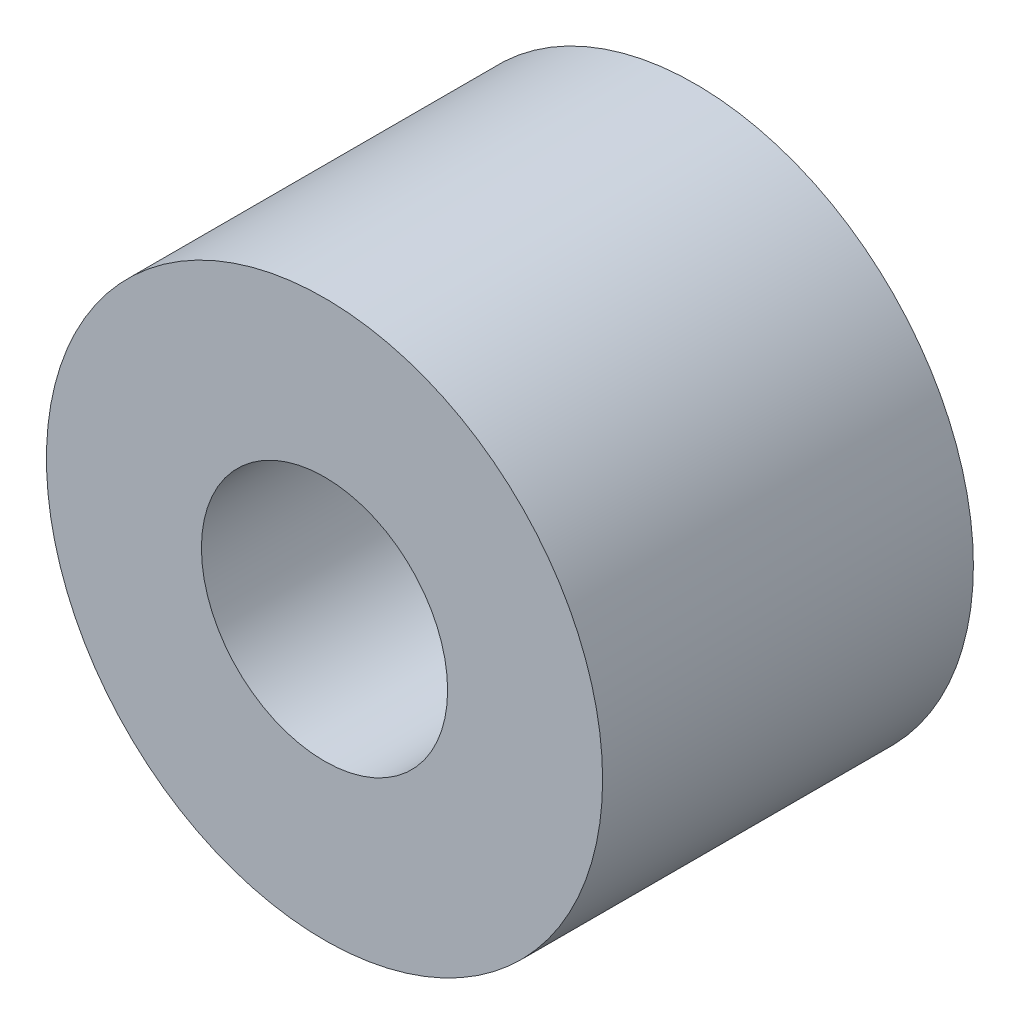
ISO-10303-21;
HEADER;
FILE_DESCRIPTION(('STEP AP214'),'2;1');
FILE_NAME('part.step','',(''),(''),'','','');
FILE_SCHEMA(('AUTOMOTIVE_DESIGN { 1 0 10303 214 1 1 1 1 }'));
ENDSEC;
DATA;
#1=APPLICATION_CONTEXT('core data for automotive mechanical design processes');
#2=APPLICATION_PROTOCOL_DEFINITION('international standard','automotive_design',2000,#1);
#3=PRODUCT_CONTEXT('',#1,'mechanical');
#4=PRODUCT('Part','Part','',(#3));
#5=PRODUCT_RELATED_PRODUCT_CATEGORY('part','',(#4));
#6=PRODUCT_DEFINITION_FORMATION('','',#4);
#7=PRODUCT_DEFINITION_CONTEXT('part definition',#1,'design');
#8=PRODUCT_DEFINITION('design','',#6,#7);
#9=PRODUCT_DEFINITION_SHAPE('','',#8);
#10=(LENGTH_UNIT() NAMED_UNIT(*) SI_UNIT(.MILLI.,.METRE.));
#11=(NAMED_UNIT(*) PLANE_ANGLE_UNIT() SI_UNIT($,.RADIAN.));
#12=(NAMED_UNIT(*) SI_UNIT($,.STERADIAN.) SOLID_ANGLE_UNIT());
#13=UNCERTAINTY_MEASURE_WITH_UNIT(LENGTH_MEASURE(1.E-05),#10,'distance_accuracy_value','');
#14=(GEOMETRIC_REPRESENTATION_CONTEXT(3) GLOBAL_UNCERTAINTY_ASSIGNED_CONTEXT((#13)) GLOBAL_UNIT_ASSIGNED_CONTEXT((#10,
#11,#12)) REPRESENTATION_CONTEXT('',''));
#15=CARTESIAN_POINT('',(0.,0.,0.));
#16=DIRECTION('',(0.,0.,1.));
#17=DIRECTION('',(1.,0.,0.));
#18=AXIS2_PLACEMENT_3D('',#15,#16,#17);
#19=CARTESIAN_POINT('',(0.,0.,3.17500000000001));
#20=DIRECTION('',(0.,0.,1.));
#21=DIRECTION('',(1.,0.,0.));
#22=AXIS2_PLACEMENT_3D('',#19,#20,#21);
#23=PLANE('',#22);
#24=CARTESIAN_POINT('',(0.,0.,3.17500000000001));
#25=DIRECTION('',(0.,0.,1.));
#26=DIRECTION('',(1.,0.,0.));
#27=AXIS2_PLACEMENT_3D('',#24,#25,#26);
#28=CIRCLE('',#27,4.7625);
#29=CARTESIAN_POINT('',(4.76250000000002,0.,3.17500000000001));
#30=VERTEX_POINT('',#29);
#31=EDGE_CURVE('E10',#30,#30,#28,.T.);
#32=ORIENTED_EDGE('',*,*,#31,.T.);
#33=EDGE_LOOP('',(#32));
#34=FACE_BOUND('',#33,.T.);
#35=CARTESIAN_POINT('',(0.,0.,3.17500000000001));
#36=DIRECTION('',(0.,0.,1.));
#37=DIRECTION('',(1.,0.,0.));
#38=AXIS2_PLACEMENT_3D('',#35,#36,#37);
#39=CIRCLE('',#38,2.1082);
#40=CARTESIAN_POINT('',(2.10820000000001,0.,3.17500000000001));
#41=VERTEX_POINT('',#40);
#42=EDGE_CURVE('E39',#41,#41,#39,.T.);
#43=ORIENTED_EDGE('',*,*,#42,.F.);
#44=EDGE_LOOP('',(#43));
#45=FACE_BOUND('',#44,.T.);
#46=ADVANCED_FACE('F32',(#34,#45),#23,.T.);
#47=CARTESIAN_POINT('',(0.,0.,3.17500000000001));
#48=DIRECTION('',(0.,0.,-1.));
#49=DIRECTION('',(-1.,0.,0.));
#50=AXIS2_PLACEMENT_3D('',#47,#48,#49);
#51=CYLINDRICAL_SURFACE('',#50,4.7625);
#52=ORIENTED_EDGE('',*,*,#31,.F.);
#53=EDGE_LOOP('',(#52));
#54=FACE_BOUND('',#53,.T.);
#55=CARTESIAN_POINT('',(0.,0.,-3.17500000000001));
#56=DIRECTION('',(0.,0.,1.));
#57=DIRECTION('',(1.,0.,0.));
#58=AXIS2_PLACEMENT_3D('',#55,#56,#57);
#59=CIRCLE('',#58,4.7625);
#60=CARTESIAN_POINT('',(4.76250000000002,0.,-3.17500000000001));
#61=VERTEX_POINT('',#60);
#62=EDGE_CURVE('E43',#61,#61,#59,.T.);
#63=ORIENTED_EDGE('',*,*,#62,.T.);
#64=EDGE_LOOP('',(#63));
#65=FACE_BOUND('',#64,.T.);
#66=ADVANCED_FACE('F34',(#54,#65),#51,.T.);
#67=CARTESIAN_POINT('',(0.,0.,3.17500000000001));
#68=DIRECTION('',(0.,0.,-1.));
#69=DIRECTION('',(-1.,0.,0.));
#70=AXIS2_PLACEMENT_3D('',#67,#68,#69);
#71=CYLINDRICAL_SURFACE('',#70,2.1082);
#72=ORIENTED_EDGE('',*,*,#42,.T.);
#73=EDGE_LOOP('',(#72));
#74=FACE_BOUND('',#73,.T.);
#75=CARTESIAN_POINT('',(0.,0.,-3.17500000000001));
#76=DIRECTION('',(0.,0.,1.));
#77=DIRECTION('',(1.,0.,0.));
#78=AXIS2_PLACEMENT_3D('',#75,#76,#77);
#79=CIRCLE('',#78,2.1082);
#80=CARTESIAN_POINT('',(2.10820000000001,0.,-3.17500000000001));
#81=VERTEX_POINT('',#80);
#82=EDGE_CURVE('E47',#81,#81,#79,.T.);
#83=ORIENTED_EDGE('',*,*,#82,.F.);
#84=EDGE_LOOP('',(#83));
#85=FACE_BOUND('',#84,.T.);
#86=ADVANCED_FACE('F56',(#74,#85),#71,.F.);
#87=CARTESIAN_POINT('',(0.,0.,-3.17500000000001));
#88=DIRECTION('',(0.,0.,1.));
#89=DIRECTION('',(1.,0.,0.));
#90=AXIS2_PLACEMENT_3D('',#87,#88,#89);
#91=PLANE('',#90);
#92=ORIENTED_EDGE('',*,*,#82,.T.);
#93=EDGE_LOOP('',(#92));
#94=FACE_BOUND('',#93,.T.);
#95=ORIENTED_EDGE('',*,*,#62,.F.);
#96=EDGE_LOOP('',(#95));
#97=FACE_BOUND('',#96,.T.);
#98=ADVANCED_FACE('F53',(#94,#97),#91,.F.);
#99=CLOSED_SHELL('',(#46,#66,#86,#98));
#100=MANIFOLD_SOLID_BREP('B2',#99);
#101=ADVANCED_BREP_SHAPE_REPRESENTATION('',(#18,#100),#14);
#102=SHAPE_DEFINITION_REPRESENTATION(#9,#101);
ENDSEC;
END-ISO-10303-21;
